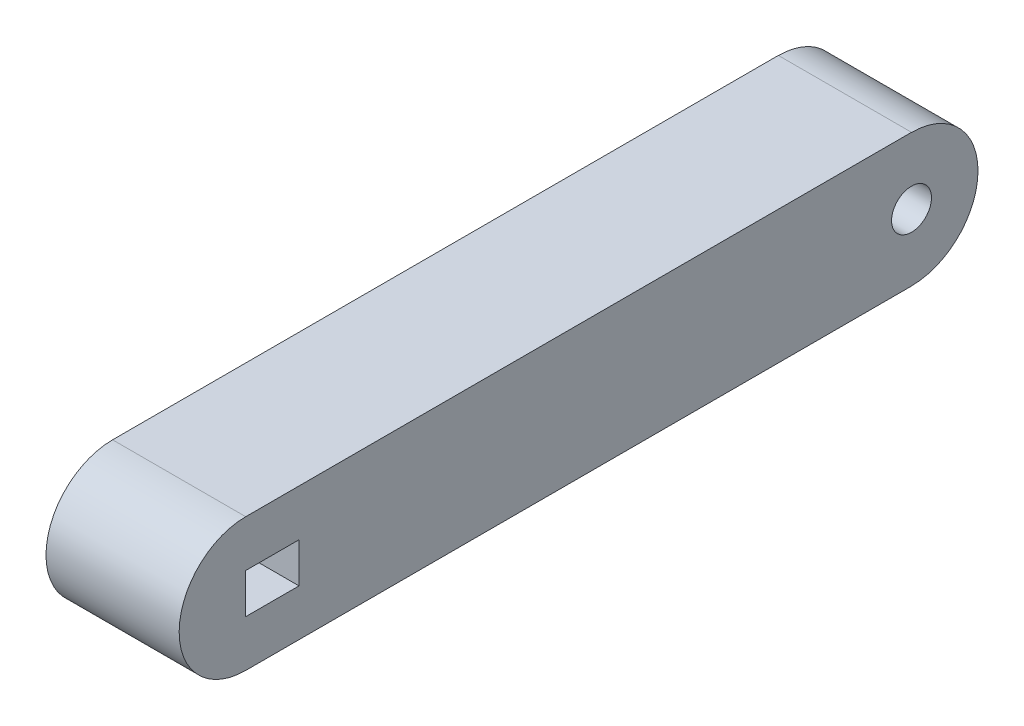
from build123d import *

# Parameters (mm, degrees)
SKETCH1_W           = 127
SKETCH1_H           = 25.4
BOSS_EXTRUDE1_DEPTH = 25.4
SKETCH5_R           = 12.7
BOSS_EXTRUDE3_DEPTH = 25.4
SKETCH26_R          = 12.681296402
BOSS_EXTRUDE4_DEPTH = 25.4
SKETCH27_R          = 3.81
CUT_EXTRUDE1_DEPTH  = 82.319677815
SKETCH29_W          = 10.16
SKETCH29_H          = 7.62
CUT_EXTRUDE4_DEPTH  = 82.319677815


with BuildPart() as part:
    # Sketch1 → Boss-Extrude1 (new body)
    with BuildSketch(Plane(origin=(0, 0, 0), x_dir=(0, 0, -1), z_dir=(1, 0, 0))):
        Rectangle(SKETCH1_W, SKETCH1_H)
    extrude(amount=BOSS_EXTRUDE1_DEPTH)

    # Sketch5 → Boss-Extrude3 (add)
    with BuildSketch(Plane(origin=(0, 0, 0), x_dir=(0, 0, -1), z_dir=(1, 0, 0))):
        with Locations((-63.5, 0)):
            Circle(SKETCH5_R)
    extrude(amount=BOSS_EXTRUDE3_DEPTH)

    # Sketch26 → Boss-Extrude4 (add)
    with BuildSketch(Plane(origin=(25.4, 0, 0), x_dir=(0, 0, -1), z_dir=(1, 0, 0))):
        with Locations((63.5, 0)):
            Circle(SKETCH26_R)
    extrude(amount=-BOSS_EXTRUDE4_DEPTH)

    # Sketch27 → Cut-Extrude1 (cut, through all)
    with BuildSketch(Plane(origin=(25.4, 0, 0), x_dir=(0, 0, -1), z_dir=(1, 0, 0))):
        with Locations((63.5, 0)):
            Circle(SKETCH27_R)
    extrude(amount=-CUT_EXTRUDE1_DEPTH, mode=Mode.SUBTRACT)

    # Sketch29 → Cut-Extrude4 (cut, through all)
    with BuildSketch(Plane(origin=(25.4, 0, 0), x_dir=(0, 0, -1), z_dir=(1, 0, 0))):
        with Locations((-58.42, 0)):
            Rectangle(SKETCH29_W, SKETCH29_H)
    extrude(amount=-CUT_EXTRUDE4_DEPTH, mode=Mode.SUBTRACT)


solid = part.part
